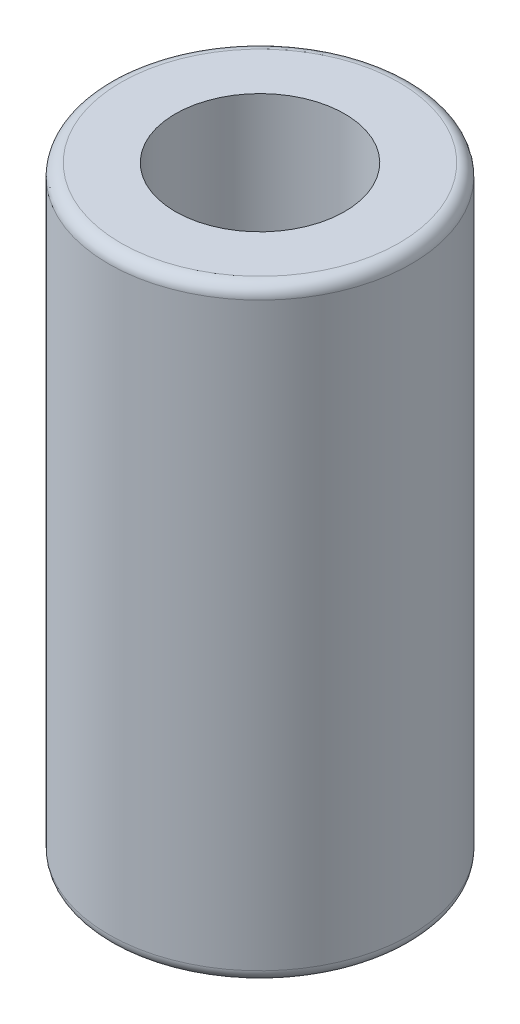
ISO-10303-21;
HEADER;
FILE_DESCRIPTION(('STEP AP214'),'2;1');
FILE_NAME('part.step','',(''),(''),'','','');
FILE_SCHEMA(('AUTOMOTIVE_DESIGN { 1 0 10303 214 1 1 1 1 }'));
ENDSEC;
DATA;
#1=APPLICATION_CONTEXT('core data for automotive mechanical design processes');
#2=APPLICATION_PROTOCOL_DEFINITION('international standard','automotive_design',2000,#1);
#3=PRODUCT_CONTEXT('',#1,'mechanical');
#4=PRODUCT('Part','Part','',(#3));
#5=PRODUCT_RELATED_PRODUCT_CATEGORY('part','',(#4));
#6=PRODUCT_DEFINITION_FORMATION('','',#4);
#7=PRODUCT_DEFINITION_CONTEXT('part definition',#1,'design');
#8=PRODUCT_DEFINITION('design','',#6,#7);
#9=PRODUCT_DEFINITION_SHAPE('','',#8);
#10=(LENGTH_UNIT() NAMED_UNIT(*) SI_UNIT(.MILLI.,.METRE.));
#11=(NAMED_UNIT(*) PLANE_ANGLE_UNIT() SI_UNIT($,.RADIAN.));
#12=(NAMED_UNIT(*) SI_UNIT($,.STERADIAN.) SOLID_ANGLE_UNIT());
#13=UNCERTAINTY_MEASURE_WITH_UNIT(LENGTH_MEASURE(1.E-05),#10,'distance_accuracy_value','');
#14=(GEOMETRIC_REPRESENTATION_CONTEXT(3) GLOBAL_UNCERTAINTY_ASSIGNED_CONTEXT((#13)) GLOBAL_UNIT_ASSIGNED_CONTEXT((#10,
#11,#12)) REPRESENTATION_CONTEXT('',''));
#15=CARTESIAN_POINT('',(0.,0.,0.));
#16=DIRECTION('',(0.,0.,1.));
#17=DIRECTION('',(1.,0.,0.));
#18=AXIS2_PLACEMENT_3D('',#15,#16,#17);
#19=CARTESIAN_POINT('',(0.,12.7,0.));
#20=DIRECTION('',(0.,1.,0.));
#21=DIRECTION('',(0.,0.,1.));
#22=AXIS2_PLACEMENT_3D('',#19,#20,#21);
#23=PLANE('',#22);
#24=CARTESIAN_POINT('',(0.,12.7,0.));
#25=DIRECTION('',(0.,1.,0.));
#26=DIRECTION('',(0.,0.,1.));
#27=AXIS2_PLACEMENT_3D('',#24,#25,#26);
#28=CIRCLE('',#27,2.921);
#29=CARTESIAN_POINT('',(0.,12.7,2.921));
#30=VERTEX_POINT('',#29);
#31=EDGE_CURVE('E10',#30,#30,#28,.T.);
#32=ORIENTED_EDGE('',*,*,#31,.T.);
#33=EDGE_LOOP('',(#32));
#34=FACE_BOUND('',#33,.T.);
#35=CARTESIAN_POINT('',(0.,12.7,0.));
#36=DIRECTION('',(0.,1.,0.));
#37=DIRECTION('',(0.,0.,1.));
#38=AXIS2_PLACEMENT_3D('',#35,#36,#37);
#39=CIRCLE('',#38,1.778);
#40=CARTESIAN_POINT('',(0.,12.7,1.778));
#41=VERTEX_POINT('',#40);
#42=EDGE_CURVE('E52',#41,#41,#39,.T.);
#43=ORIENTED_EDGE('',*,*,#42,.F.);
#44=EDGE_LOOP('',(#43));
#45=FACE_BOUND('',#44,.T.);
#46=ADVANCED_FACE('F32',(#34,#45),#23,.T.);
#47=CARTESIAN_POINT('',(0.,0.,0.));
#48=DIRECTION('',(0.,1.,0.));
#49=DIRECTION('',(0.,0.,1.));
#50=AXIS2_PLACEMENT_3D('',#47,#48,#49);
#51=PLANE('',#50);
#52=CARTESIAN_POINT('',(0.,0.,0.));
#53=DIRECTION('',(0.,1.,0.));
#54=DIRECTION('',(0.,0.,1.));
#55=AXIS2_PLACEMENT_3D('',#52,#53,#54);
#56=CIRCLE('',#55,2.921);
#57=CARTESIAN_POINT('',(0.,0.,2.921));
#58=VERTEX_POINT('',#57);
#59=EDGE_CURVE('E39',#58,#58,#56,.F.);
#60=ORIENTED_EDGE('',*,*,#59,.T.);
#61=EDGE_LOOP('',(#60));
#62=FACE_BOUND('',#61,.T.);
#63=CARTESIAN_POINT('',(0.,0.,0.));
#64=DIRECTION('',(0.,1.,0.));
#65=DIRECTION('',(0.,0.,1.));
#66=AXIS2_PLACEMENT_3D('',#63,#64,#65);
#67=CIRCLE('',#66,1.778);
#68=CARTESIAN_POINT('',(0.,0.,1.778));
#69=VERTEX_POINT('',#68);
#70=EDGE_CURVE('E53',#69,#69,#67,.T.);
#71=ORIENTED_EDGE('',*,*,#70,.T.);
#72=EDGE_LOOP('',(#71));
#73=FACE_BOUND('',#72,.T.);
#74=ADVANCED_FACE('F63',(#62,#73),#51,.F.);
#75=CARTESIAN_POINT('',(0.,12.7,0.));
#76=DIRECTION('',(0.,-1.,0.));
#77=DIRECTION('',(0.,0.,-1.));
#78=AXIS2_PLACEMENT_3D('',#75,#76,#77);
#79=CYLINDRICAL_SURFACE('',#78,3.175);
#80=CARTESIAN_POINT('',(0.,0.254000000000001,0.));
#81=DIRECTION('',(0.,1.,0.));
#82=DIRECTION('',(0.,0.,1.));
#83=AXIS2_PLACEMENT_3D('',#80,#81,#82);
#84=CIRCLE('',#83,3.175);
#85=CARTESIAN_POINT('',(0.,0.254000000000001,3.175));
#86=VERTEX_POINT('',#85);
#87=EDGE_CURVE('E43',#86,#86,#84,.T.);
#88=ORIENTED_EDGE('',*,*,#87,.T.);
#89=EDGE_LOOP('',(#88));
#90=FACE_BOUND('',#89,.T.);
#91=CARTESIAN_POINT('',(0.,12.446,0.));
#92=DIRECTION('',(0.,1.,0.));
#93=DIRECTION('',(0.,0.,1.));
#94=AXIS2_PLACEMENT_3D('',#91,#92,#93);
#95=CIRCLE('',#94,3.175);
#96=CARTESIAN_POINT('',(0.,12.446,3.175));
#97=VERTEX_POINT('',#96);
#98=EDGE_CURVE('E47',#97,#97,#95,.F.);
#99=ORIENTED_EDGE('',*,*,#98,.T.);
#100=EDGE_LOOP('',(#99));
#101=FACE_BOUND('',#100,.T.);
#102=ADVANCED_FACE('F68',(#90,#101),#79,.T.);
#103=CARTESIAN_POINT('',(0.,12.7,0.));
#104=DIRECTION('',(0.,-1.,0.));
#105=DIRECTION('',(0.,0.,-1.));
#106=AXIS2_PLACEMENT_3D('',#103,#104,#105);
#107=CYLINDRICAL_SURFACE('',#106,1.778);
#108=ORIENTED_EDGE('',*,*,#42,.T.);
#109=EDGE_LOOP('',(#108));
#110=FACE_BOUND('',#109,.T.);
#111=ORIENTED_EDGE('',*,*,#70,.F.);
#112=EDGE_LOOP('',(#111));
#113=FACE_BOUND('',#112,.T.);
#114=ADVANCED_FACE('F59',(#110,#113),#107,.F.);
#115=CARTESIAN_POINT('',(0.,0.254000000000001,0.));
#116=DIRECTION('',(0.,1.,0.));
#117=DIRECTION('',(0.,0.,1.));
#118=AXIS2_PLACEMENT_3D('',#115,#116,#117);
#119=TOROIDAL_SURFACE('',#118,2.921,0.254);
#120=ORIENTED_EDGE('',*,*,#59,.F.);
#121=EDGE_LOOP('',(#120));
#122=FACE_BOUND('',#121,.T.);
#123=ORIENTED_EDGE('',*,*,#87,.F.);
#124=EDGE_LOOP('',(#123));
#125=FACE_BOUND('',#124,.T.);
#126=ADVANCED_FACE('F74',(#122,#125),#119,.T.);
#127=CARTESIAN_POINT('',(0.,12.446,0.));
#128=DIRECTION('',(0.,1.,0.));
#129=DIRECTION('',(0.,0.,1.));
#130=AXIS2_PLACEMENT_3D('',#127,#128,#129);
#131=TOROIDAL_SURFACE('',#130,2.921,0.254);
#132=ORIENTED_EDGE('',*,*,#98,.F.);
#133=EDGE_LOOP('',(#132));
#134=FACE_BOUND('',#133,.T.);
#135=ORIENTED_EDGE('',*,*,#31,.F.);
#136=EDGE_LOOP('',(#135));
#137=FACE_BOUND('',#136,.T.);
#138=ADVANCED_FACE('F34',(#134,#137),#131,.T.);
#139=CLOSED_SHELL('',(#46,#74,#102,#114,#126,#138));
#140=MANIFOLD_SOLID_BREP('B2',#139);
#141=ADVANCED_BREP_SHAPE_REPRESENTATION('',(#18,#140),#14);
#142=SHAPE_DEFINITION_REPRESENTATION(#9,#141);
ENDSEC;
END-ISO-10303-21;
